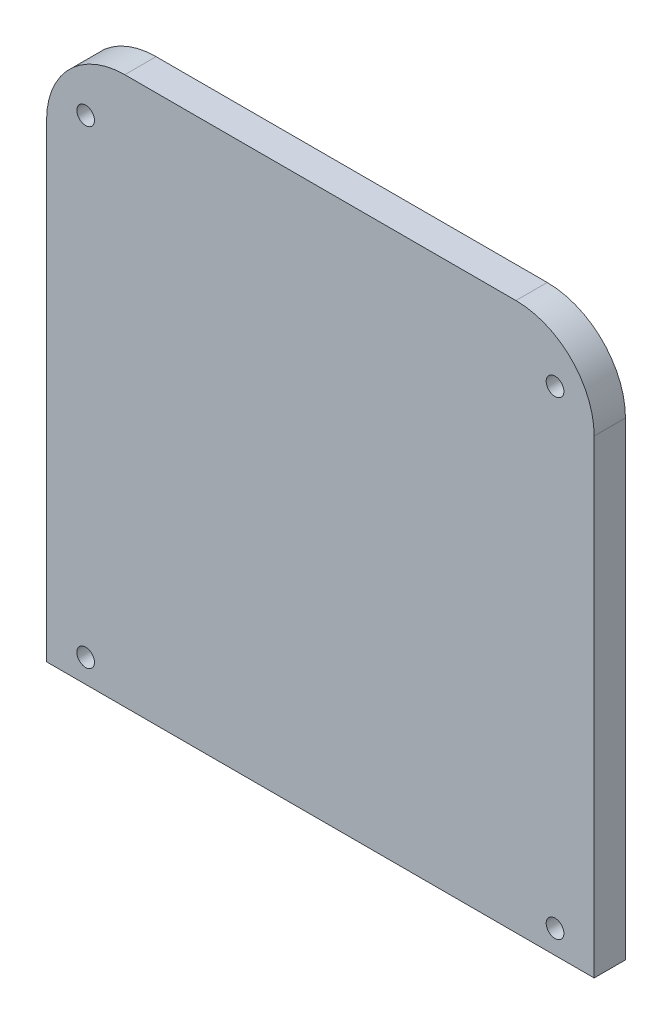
ISO-10303-21;
HEADER;
FILE_DESCRIPTION(('STEP AP214'),'2;1');
FILE_NAME('part.step','',(''),(''),'','','');
FILE_SCHEMA(('AUTOMOTIVE_DESIGN { 1 0 10303 214 1 1 1 1 }'));
ENDSEC;
DATA;
#1=APPLICATION_CONTEXT('core data for automotive mechanical design processes');
#2=APPLICATION_PROTOCOL_DEFINITION('international standard','automotive_design',2000,#1);
#3=PRODUCT_CONTEXT('',#1,'mechanical');
#4=PRODUCT('Part','Part','',(#3));
#5=PRODUCT_RELATED_PRODUCT_CATEGORY('part','',(#4));
#6=PRODUCT_DEFINITION_FORMATION('','',#4);
#7=PRODUCT_DEFINITION_CONTEXT('part definition',#1,'design');
#8=PRODUCT_DEFINITION('design','',#6,#7);
#9=PRODUCT_DEFINITION_SHAPE('','',#8);
#10=(LENGTH_UNIT() NAMED_UNIT(*) SI_UNIT(.MILLI.,.METRE.));
#11=(NAMED_UNIT(*) PLANE_ANGLE_UNIT() SI_UNIT($,.RADIAN.));
#12=(NAMED_UNIT(*) SI_UNIT($,.STERADIAN.) SOLID_ANGLE_UNIT());
#13=UNCERTAINTY_MEASURE_WITH_UNIT(LENGTH_MEASURE(1.E-05),#10,'distance_accuracy_value','');
#14=(GEOMETRIC_REPRESENTATION_CONTEXT(3) GLOBAL_UNCERTAINTY_ASSIGNED_CONTEXT((#13)) GLOBAL_UNIT_ASSIGNED_CONTEXT((#10,
#11,#12)) REPRESENTATION_CONTEXT('',''));
#15=CARTESIAN_POINT('',(0.,0.,0.));
#16=DIRECTION('',(0.,0.,1.));
#17=DIRECTION('',(1.,0.,0.));
#18=AXIS2_PLACEMENT_3D('',#15,#16,#17);
#19=CARTESIAN_POINT('',(-35.,-35.,4.));
#20=DIRECTION('',(1.,0.,0.));
#21=DIRECTION('',(0.,0.,-1.));
#22=AXIS2_PLACEMENT_3D('',#19,#20,#21);
#23=PLANE('',#22);
#24=DIRECTION('',(0.,-1.,0.));
#25=VECTOR('',#24,1.);
#26=CARTESIAN_POINT('',(-35.,-35.,4.));
#27=LINE('',#26,#25);
#28=CARTESIAN_POINT('',(-35.,25.,4.));
#29=VERTEX_POINT('',#28);
#30=CARTESIAN_POINT('',(-35.,-35.,4.));
#31=VERTEX_POINT('',#30);
#32=EDGE_CURVE('E88',#29,#31,#27,.T.);
#33=ORIENTED_EDGE('',*,*,#32,.F.);
#34=DIRECTION('',(0.,0.,-1.));
#35=VECTOR('',#34,1.);
#36=CARTESIAN_POINT('',(-35.,25.,4.));
#37=LINE('',#36,#35);
#38=CARTESIAN_POINT('',(-35.,25.,0.));
#39=VERTEX_POINT('',#38);
#40=EDGE_CURVE('E11',#29,#39,#37,.T.);
#41=ORIENTED_EDGE('',*,*,#40,.T.);
#42=DIRECTION('',(0.,-1.,0.));
#43=VECTOR('',#42,1.);
#44=CARTESIAN_POINT('',(-35.,-35.,0.));
#45=LINE('',#44,#43);
#46=CARTESIAN_POINT('',(-35.,-35.,0.));
#47=VERTEX_POINT('',#46);
#48=EDGE_CURVE('E107',#39,#47,#45,.T.);
#49=ORIENTED_EDGE('',*,*,#48,.T.);
#50=DIRECTION('',(0.,0.,-1.));
#51=VECTOR('',#50,1.);
#52=CARTESIAN_POINT('',(-35.,-35.,4.));
#53=LINE('',#52,#51);
#54=EDGE_CURVE('E101',#31,#47,#53,.T.);
#55=ORIENTED_EDGE('',*,*,#54,.F.);
#56=EDGE_LOOP('',(#33,#41,#49,#55));
#57=FACE_BOUND('',#56,.T.);
#58=ADVANCED_FACE('F35',(#57),#23,.F.);
#59=CARTESIAN_POINT('',(35.,-35.,4.));
#60=DIRECTION('',(0.,1.,0.));
#61=DIRECTION('',(0.,0.,1.));
#62=AXIS2_PLACEMENT_3D('',#59,#60,#61);
#63=PLANE('',#62);
#64=DIRECTION('',(1.,0.,0.));
#65=VECTOR('',#64,1.);
#66=CARTESIAN_POINT('',(35.,-35.,0.));
#67=LINE('',#66,#65);
#68=CARTESIAN_POINT('',(35.,-35.,0.));
#69=VERTEX_POINT('',#68);
#70=EDGE_CURVE('E140',#47,#69,#67,.T.);
#71=ORIENTED_EDGE('',*,*,#70,.T.);
#72=DIRECTION('',(0.,0.,-1.));
#73=VECTOR('',#72,1.);
#74=CARTESIAN_POINT('',(35.,-35.,4.));
#75=LINE('',#74,#73);
#76=CARTESIAN_POINT('',(35.,-35.,4.));
#77=VERTEX_POINT('',#76);
#78=EDGE_CURVE('E103',#77,#69,#75,.T.);
#79=ORIENTED_EDGE('',*,*,#78,.F.);
#80=DIRECTION('',(1.,0.,0.));
#81=VECTOR('',#80,1.);
#82=CARTESIAN_POINT('',(35.,-35.,4.));
#83=LINE('',#82,#81);
#84=EDGE_CURVE('E91',#31,#77,#83,.T.);
#85=ORIENTED_EDGE('',*,*,#84,.F.);
#86=ORIENTED_EDGE('',*,*,#54,.T.);
#87=EDGE_LOOP('',(#71,#79,#85,#86));
#88=FACE_BOUND('',#87,.T.);
#89=ADVANCED_FACE('F100',(#88),#63,.F.);
#90=CARTESIAN_POINT('',(35.,-35.,4.));
#91=DIRECTION('',(-1.,0.,0.));
#92=DIRECTION('',(0.,0.,1.));
#93=AXIS2_PLACEMENT_3D('',#90,#91,#92);
#94=PLANE('',#93);
#95=DIRECTION('',(0.,1.,0.));
#96=VECTOR('',#95,1.);
#97=CARTESIAN_POINT('',(35.,-35.,0.));
#98=LINE('',#97,#96);
#99=CARTESIAN_POINT('',(35.,25.,0.));
#100=VERTEX_POINT('',#99);
#101=EDGE_CURVE('E138',#69,#100,#98,.T.);
#102=ORIENTED_EDGE('',*,*,#101,.T.);
#103=DIRECTION('',(0.,0.,-1.));
#104=VECTOR('',#103,1.);
#105=CARTESIAN_POINT('',(35.,25.,4.));
#106=LINE('',#105,#104);
#107=CARTESIAN_POINT('',(35.,25.,4.));
#108=VERTEX_POINT('',#107);
#109=EDGE_CURVE('E58',#100,#108,#106,.F.);
#110=ORIENTED_EDGE('',*,*,#109,.T.);
#111=DIRECTION('',(0.,1.,0.));
#112=VECTOR('',#111,1.);
#113=CARTESIAN_POINT('',(35.,-35.,4.));
#114=LINE('',#113,#112);
#115=EDGE_CURVE('E104',#77,#108,#114,.T.);
#116=ORIENTED_EDGE('',*,*,#115,.F.);
#117=ORIENTED_EDGE('',*,*,#78,.T.);
#118=EDGE_LOOP('',(#102,#110,#116,#117));
#119=FACE_BOUND('',#118,.T.);
#120=ADVANCED_FACE('F139',(#119),#94,.F.);
#121=CARTESIAN_POINT('',(35.,35.,4.));
#122=DIRECTION('',(0.,-1.,0.));
#123=DIRECTION('',(1.,0.,0.));
#124=AXIS2_PLACEMENT_3D('',#121,#122,#123);
#125=PLANE('',#124);
#126=DIRECTION('',(-1.,0.,0.));
#127=VECTOR('',#126,1.);
#128=CARTESIAN_POINT('',(35.,35.,4.));
#129=LINE('',#128,#127);
#130=CARTESIAN_POINT('',(25.,35.,4.));
#131=VERTEX_POINT('',#130);
#132=CARTESIAN_POINT('',(-25.,35.,4.));
#133=VERTEX_POINT('',#132);
#134=EDGE_CURVE('E113',#131,#133,#129,.T.);
#135=ORIENTED_EDGE('',*,*,#134,.F.);
#136=DIRECTION('',(0.,0.,-1.));
#137=VECTOR('',#136,1.);
#138=CARTESIAN_POINT('',(25.,35.,4.));
#139=LINE('',#138,#137);
#140=CARTESIAN_POINT('',(25.,35.,0.));
#141=VERTEX_POINT('',#140);
#142=EDGE_CURVE('E111',#131,#141,#139,.T.);
#143=ORIENTED_EDGE('',*,*,#142,.T.);
#144=DIRECTION('',(-1.,0.,0.));
#145=VECTOR('',#144,1.);
#146=CARTESIAN_POINT('',(35.,35.,0.));
#147=LINE('',#146,#145);
#148=CARTESIAN_POINT('',(-25.,35.,0.));
#149=VERTEX_POINT('',#148);
#150=EDGE_CURVE('E96',#141,#149,#147,.T.);
#151=ORIENTED_EDGE('',*,*,#150,.T.);
#152=DIRECTION('',(0.,0.,-1.));
#153=VECTOR('',#152,1.);
#154=CARTESIAN_POINT('',(-25.,35.,4.));
#155=LINE('',#154,#153);
#156=EDGE_CURVE('E109',#149,#133,#155,.F.);
#157=ORIENTED_EDGE('',*,*,#156,.T.);
#158=EDGE_LOOP('',(#135,#143,#151,#157));
#159=FACE_BOUND('',#158,.T.);
#160=ADVANCED_FACE('F129',(#159),#125,.F.);
#161=CARTESIAN_POINT('',(0.,0.,4.));
#162=DIRECTION('',(0.,0.,1.));
#163=DIRECTION('',(1.,0.,0.));
#164=AXIS2_PLACEMENT_3D('',#161,#162,#163);
#165=PLANE('',#164);
#166=CARTESIAN_POINT('',(30.,28.,4.));
#167=DIRECTION('',(0.,0.,-1.));
#168=DIRECTION('',(-1.,0.,0.));
#169=AXIS2_PLACEMENT_3D('',#166,#167,#168);
#170=CIRCLE('',#169,1.1303);
#171=CARTESIAN_POINT('',(28.8697,28.,4.));
#172=VERTEX_POINT('',#171);
#173=EDGE_CURVE('E164',#172,#172,#170,.T.);
#174=ORIENTED_EDGE('',*,*,#173,.T.);
#175=EDGE_LOOP('',(#174));
#176=FACE_BOUND('',#175,.T.);
#177=CARTESIAN_POINT('',(-30.,-32.,4.));
#178=DIRECTION('',(0.,0.,-1.));
#179=DIRECTION('',(-1.,0.,0.));
#180=AXIS2_PLACEMENT_3D('',#177,#178,#179);
#181=CIRCLE('',#180,1.1303);
#182=CARTESIAN_POINT('',(-31.1303,-32.,4.));
#183=VERTEX_POINT('',#182);
#184=EDGE_CURVE('E158',#183,#183,#181,.T.);
#185=ORIENTED_EDGE('',*,*,#184,.T.);
#186=EDGE_LOOP('',(#185));
#187=FACE_BOUND('',#186,.T.);
#188=CARTESIAN_POINT('',(-30.,28.,4.));
#189=DIRECTION('',(0.,0.,-1.));
#190=DIRECTION('',(-1.,0.,0.));
#191=AXIS2_PLACEMENT_3D('',#188,#189,#190);
#192=CIRCLE('',#191,1.1303);
#193=CARTESIAN_POINT('',(-31.1303,28.,4.));
#194=VERTEX_POINT('',#193);
#195=EDGE_CURVE('E152',#194,#194,#192,.T.);
#196=ORIENTED_EDGE('',*,*,#195,.T.);
#197=EDGE_LOOP('',(#196));
#198=FACE_BOUND('',#197,.T.);
#199=CARTESIAN_POINT('',(30.,-32.,4.));
#200=DIRECTION('',(0.,0.,-1.));
#201=DIRECTION('',(-1.,0.,0.));
#202=AXIS2_PLACEMENT_3D('',#199,#200,#201);
#203=CIRCLE('',#202,1.1303);
#204=CARTESIAN_POINT('',(28.8697,-32.,4.));
#205=VERTEX_POINT('',#204);
#206=EDGE_CURVE('E144',#205,#205,#203,.T.);
#207=ORIENTED_EDGE('',*,*,#206,.T.);
#208=EDGE_LOOP('',(#207));
#209=FACE_BOUND('',#208,.T.);
#210=ORIENTED_EDGE('',*,*,#115,.T.);
#211=CARTESIAN_POINT('',(25.,25.,4.));
#212=DIRECTION('',(0.,0.,1.));
#213=DIRECTION('',(1.,0.,0.));
#214=AXIS2_PLACEMENT_3D('',#211,#212,#213);
#215=CIRCLE('',#214,10.);
#216=EDGE_CURVE('E43',#108,#131,#215,.T.);
#217=ORIENTED_EDGE('',*,*,#216,.T.);
#218=ORIENTED_EDGE('',*,*,#134,.T.);
#219=CARTESIAN_POINT('',(-25.,25.,4.));
#220=DIRECTION('',(0.,0.,1.));
#221=DIRECTION('',(1.,0.,0.));
#222=AXIS2_PLACEMENT_3D('',#219,#220,#221);
#223=CIRCLE('',#222,10.);
#224=EDGE_CURVE('E50',#133,#29,#223,.T.);
#225=ORIENTED_EDGE('',*,*,#224,.T.);
#226=ORIENTED_EDGE('',*,*,#32,.T.);
#227=ORIENTED_EDGE('',*,*,#84,.T.);
#228=EDGE_LOOP('',(#210,#217,#218,#225,#226,#227));
#229=FACE_BOUND('',#228,.T.);
#230=ADVANCED_FACE('F90',(#176,#187,#198,#209,#229),#165,.T.);
#231=CARTESIAN_POINT('',(0.,0.,0.));
#232=DIRECTION('',(0.,0.,1.));
#233=DIRECTION('',(1.,0.,0.));
#234=AXIS2_PLACEMENT_3D('',#231,#232,#233);
#235=PLANE('',#234);
#236=CARTESIAN_POINT('',(30.,28.,0.));
#237=DIRECTION('',(0.,0.,-1.));
#238=DIRECTION('',(-1.,0.,0.));
#239=AXIS2_PLACEMENT_3D('',#236,#237,#238);
#240=CIRCLE('',#239,1.13029999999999);
#241=CARTESIAN_POINT('',(28.8697,28.,0.));
#242=VERTEX_POINT('',#241);
#243=EDGE_CURVE('E167',#242,#242,#240,.T.);
#244=ORIENTED_EDGE('',*,*,#243,.F.);
#245=EDGE_LOOP('',(#244));
#246=FACE_BOUND('',#245,.T.);
#247=CARTESIAN_POINT('',(-30.,-32.,0.));
#248=DIRECTION('',(0.,0.,-1.));
#249=DIRECTION('',(-1.,0.,0.));
#250=AXIS2_PLACEMENT_3D('',#247,#248,#249);
#251=CIRCLE('',#250,1.13029999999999);
#252=CARTESIAN_POINT('',(-31.1303,-32.,0.));
#253=VERTEX_POINT('',#252);
#254=EDGE_CURVE('E161',#253,#253,#251,.T.);
#255=ORIENTED_EDGE('',*,*,#254,.F.);
#256=EDGE_LOOP('',(#255));
#257=FACE_BOUND('',#256,.T.);
#258=CARTESIAN_POINT('',(-30.,28.,0.));
#259=DIRECTION('',(0.,0.,-1.));
#260=DIRECTION('',(-1.,0.,0.));
#261=AXIS2_PLACEMENT_3D('',#258,#259,#260);
#262=CIRCLE('',#261,1.13029999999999);
#263=CARTESIAN_POINT('',(-31.1303,28.,0.));
#264=VERTEX_POINT('',#263);
#265=EDGE_CURVE('E155',#264,#264,#262,.T.);
#266=ORIENTED_EDGE('',*,*,#265,.F.);
#267=EDGE_LOOP('',(#266));
#268=FACE_BOUND('',#267,.T.);
#269=CARTESIAN_POINT('',(30.,-32.,0.));
#270=DIRECTION('',(0.,0.,-1.));
#271=DIRECTION('',(-1.,0.,0.));
#272=AXIS2_PLACEMENT_3D('',#269,#270,#271);
#273=CIRCLE('',#272,1.13029999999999);
#274=CARTESIAN_POINT('',(28.8697,-32.,0.));
#275=VERTEX_POINT('',#274);
#276=EDGE_CURVE('E149',#275,#275,#273,.T.);
#277=ORIENTED_EDGE('',*,*,#276,.F.);
#278=EDGE_LOOP('',(#277));
#279=FACE_BOUND('',#278,.T.);
#280=ORIENTED_EDGE('',*,*,#150,.F.);
#281=CARTESIAN_POINT('',(25.,25.,0.));
#282=DIRECTION('',(0.,0.,1.));
#283=DIRECTION('',(1.,0.,0.));
#284=AXIS2_PLACEMENT_3D('',#281,#282,#283);
#285=CIRCLE('',#284,10.);
#286=EDGE_CURVE('E121',#141,#100,#285,.F.);
#287=ORIENTED_EDGE('',*,*,#286,.T.);
#288=ORIENTED_EDGE('',*,*,#101,.F.);
#289=ORIENTED_EDGE('',*,*,#70,.F.);
#290=ORIENTED_EDGE('',*,*,#48,.F.);
#291=CARTESIAN_POINT('',(-25.,25.,0.));
#292=DIRECTION('',(0.,0.,1.));
#293=DIRECTION('',(1.,0.,0.));
#294=AXIS2_PLACEMENT_3D('',#291,#292,#293);
#295=CIRCLE('',#294,10.);
#296=EDGE_CURVE('E119',#39,#149,#295,.F.);
#297=ORIENTED_EDGE('',*,*,#296,.T.);
#298=EDGE_LOOP('',(#280,#287,#288,#289,#290,#297));
#299=FACE_BOUND('',#298,.T.);
#300=ADVANCED_FACE('F137',(#246,#257,#268,#279,#299),#235,.F.);
#301=CARTESIAN_POINT('',(30.,-32.,0.));
#302=DIRECTION('',(0.,0.,-1.));
#303=DIRECTION('',(-1.,0.,0.));
#304=AXIS2_PLACEMENT_3D('',#301,#302,#303);
#305=CYLINDRICAL_SURFACE('',#304,1.13029999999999);
#306=ORIENTED_EDGE('',*,*,#206,.F.);
#307=EDGE_LOOP('',(#306));
#308=FACE_BOUND('',#307,.T.);
#309=ORIENTED_EDGE('',*,*,#276,.T.);
#310=EDGE_LOOP('',(#309));
#311=FACE_BOUND('',#310,.T.);
#312=ADVANCED_FACE('F175',(#308,#311),#305,.F.);
#313=CARTESIAN_POINT('',(-30.,28.,0.));
#314=DIRECTION('',(0.,0.,-1.));
#315=DIRECTION('',(-1.,0.,0.));
#316=AXIS2_PLACEMENT_3D('',#313,#314,#315);
#317=CYLINDRICAL_SURFACE('',#316,1.13029999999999);
#318=ORIENTED_EDGE('',*,*,#195,.F.);
#319=EDGE_LOOP('',(#318));
#320=FACE_BOUND('',#319,.T.);
#321=ORIENTED_EDGE('',*,*,#265,.T.);
#322=EDGE_LOOP('',(#321));
#323=FACE_BOUND('',#322,.T.);
#324=ADVANCED_FACE('F184',(#320,#323),#317,.F.);
#325=CARTESIAN_POINT('',(-30.,-32.,0.));
#326=DIRECTION('',(0.,0.,-1.));
#327=DIRECTION('',(-1.,0.,0.));
#328=AXIS2_PLACEMENT_3D('',#325,#326,#327);
#329=CYLINDRICAL_SURFACE('',#328,1.13029999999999);
#330=ORIENTED_EDGE('',*,*,#184,.F.);
#331=EDGE_LOOP('',(#330));
#332=FACE_BOUND('',#331,.T.);
#333=ORIENTED_EDGE('',*,*,#254,.T.);
#334=EDGE_LOOP('',(#333));
#335=FACE_BOUND('',#334,.T.);
#336=ADVANCED_FACE('F190',(#332,#335),#329,.F.);
#337=CARTESIAN_POINT('',(30.,28.,0.));
#338=DIRECTION('',(0.,0.,-1.));
#339=DIRECTION('',(-1.,0.,0.));
#340=AXIS2_PLACEMENT_3D('',#337,#338,#339);
#341=CYLINDRICAL_SURFACE('',#340,1.13029999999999);
#342=ORIENTED_EDGE('',*,*,#173,.F.);
#343=EDGE_LOOP('',(#342));
#344=FACE_BOUND('',#343,.T.);
#345=ORIENTED_EDGE('',*,*,#243,.T.);
#346=EDGE_LOOP('',(#345));
#347=FACE_BOUND('',#346,.T.);
#348=ADVANCED_FACE('F171',(#344,#347),#341,.F.);
#349=CARTESIAN_POINT('',(25.,25.,4.));
#350=DIRECTION('',(0.,0.,-1.));
#351=DIRECTION('',(-1.,0.,0.));
#352=AXIS2_PLACEMENT_3D('',#349,#350,#351);
#353=CYLINDRICAL_SURFACE('',#352,10.);
#354=ORIENTED_EDGE('',*,*,#216,.F.);
#355=ORIENTED_EDGE('',*,*,#109,.F.);
#356=ORIENTED_EDGE('',*,*,#286,.F.);
#357=ORIENTED_EDGE('',*,*,#142,.F.);
#358=EDGE_LOOP('',(#354,#355,#356,#357));
#359=FACE_BOUND('',#358,.T.);
#360=ADVANCED_FACE('F134',(#359),#353,.T.);
#361=CARTESIAN_POINT('',(-25.,25.,4.));
#362=DIRECTION('',(0.,0.,-1.));
#363=DIRECTION('',(-1.,0.,0.));
#364=AXIS2_PLACEMENT_3D('',#361,#362,#363);
#365=CYLINDRICAL_SURFACE('',#364,10.);
#366=ORIENTED_EDGE('',*,*,#224,.F.);
#367=ORIENTED_EDGE('',*,*,#156,.F.);
#368=ORIENTED_EDGE('',*,*,#296,.F.);
#369=ORIENTED_EDGE('',*,*,#40,.F.);
#370=EDGE_LOOP('',(#366,#367,#368,#369));
#371=FACE_BOUND('',#370,.T.);
#372=ADVANCED_FACE('F37',(#371),#365,.T.);
#373=CLOSED_SHELL('',(#58,#89,#120,#160,#230,#300,#312,#324,#336,#348,#360,#372));
#374=MANIFOLD_SOLID_BREP('B2',#373);
#375=ADVANCED_BREP_SHAPE_REPRESENTATION('',(#18,#374),#14);
#376=SHAPE_DEFINITION_REPRESENTATION(#9,#375);
ENDSEC;
END-ISO-10303-21;
